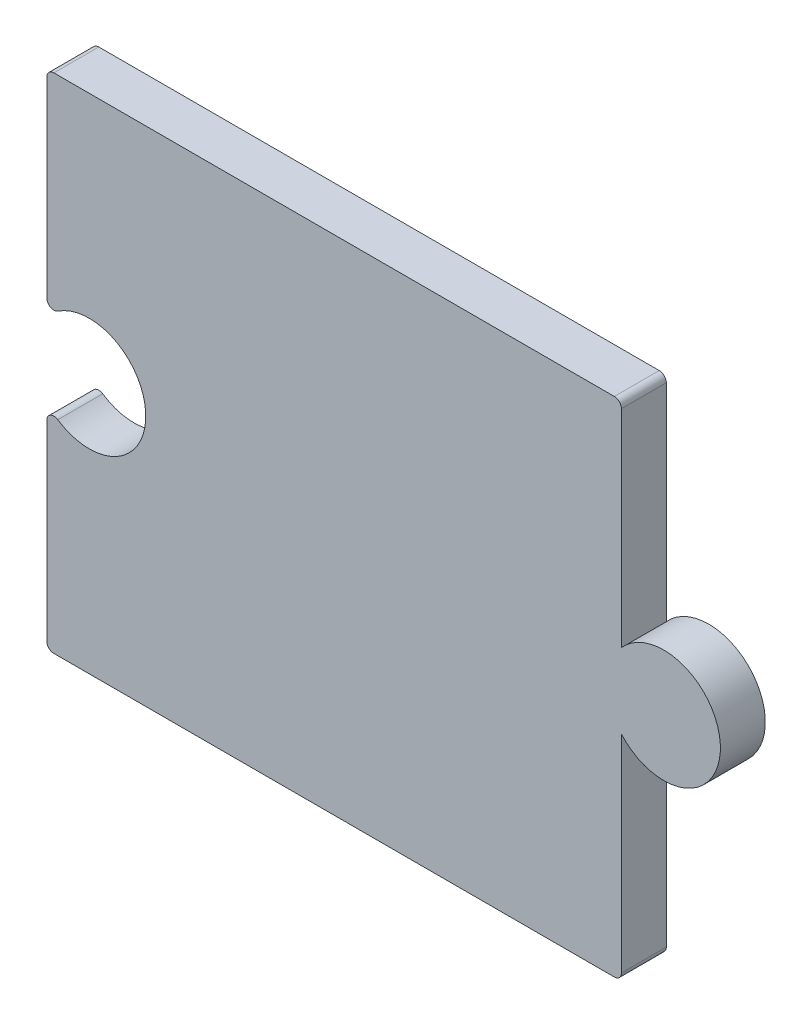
from build123d import *

# Parameters (mm, degrees)
BOSS_EXTRUDE1_DEPTH = 3.175
FILLET1_R           = 0.5


with BuildPart() as part:
    # Sketch1 → Boss-Extrude1 (new body)
    with BuildSketch(Plane.XY):
        with BuildLine():
            Line((40.64, 35.56), (40.64, 20.425751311))
            ThreePointArc((40.64, 20.425751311), (47.64, 17.78), (40.64, 15.134248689))
            Line((40.64, 15.134248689), (40.64, 0))
            Line((40.64, 0), (0, 0))
            Line((0, 0), (0, 15.134248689))
            ThreePointArc((0, 15.134248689), (7, 17.78), (0, 20.425751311))
            Line((0, 20.425751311), (0, 35.56))
            Line((0, 35.56), (40.64, 35.56))
        make_face()
    extrude(amount=BOSS_EXTRUDE1_DEPTH)

    # Fillet1
    fillet1_edges = [part.edges().sort_by_distance(p)[0] for p in [
        (0, 15.134248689, 1.5875),
        (0, 20.425751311, 1.5875),
        (0, 35.56, 1.5875),
        (40.64, 35.56, 1.5875),
        (40.64, 0, 1.5875),
        (0, 0, 1.5875),
    ]]
    fillet(fillet1_edges, radius=FILLET1_R)


solid = part.part
